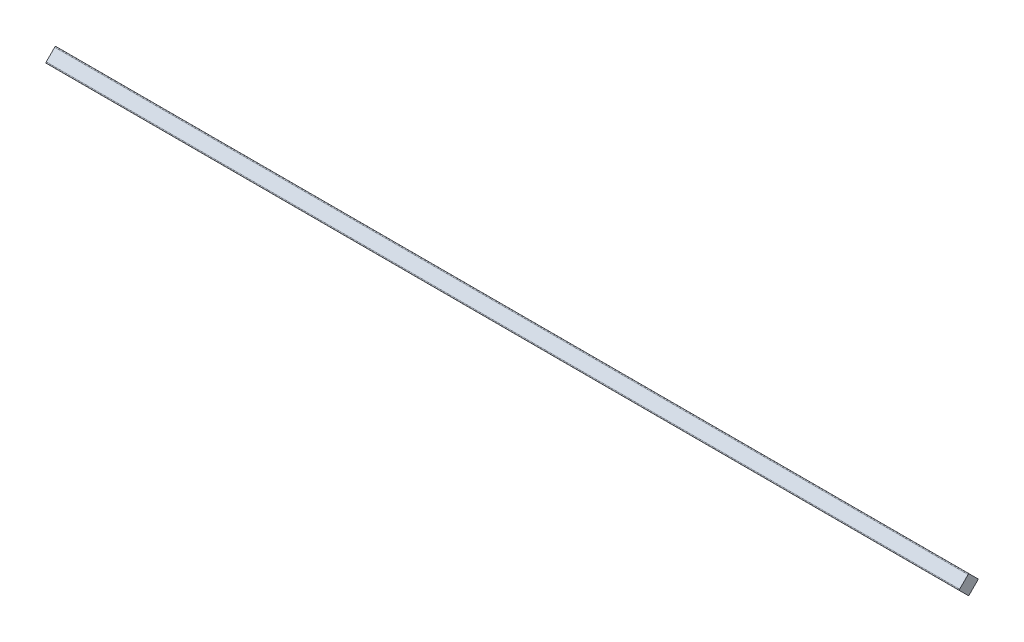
ISO-10303-21;
HEADER;
FILE_DESCRIPTION(('STEP AP214'),'2;1');
FILE_NAME('part.step','',(''),(''),'','','');
FILE_SCHEMA(('AUTOMOTIVE_DESIGN { 1 0 10303 214 1 1 1 1 }'));
ENDSEC;
DATA;
#1=APPLICATION_CONTEXT('core data for automotive mechanical design processes');
#2=APPLICATION_PROTOCOL_DEFINITION('international standard','automotive_design',2000,#1);
#3=PRODUCT_CONTEXT('',#1,'mechanical');
#4=PRODUCT('Part','Part','',(#3));
#5=PRODUCT_RELATED_PRODUCT_CATEGORY('part','',(#4));
#6=PRODUCT_DEFINITION_FORMATION('','',#4);
#7=PRODUCT_DEFINITION_CONTEXT('part definition',#1,'design');
#8=PRODUCT_DEFINITION('design','',#6,#7);
#9=PRODUCT_DEFINITION_SHAPE('','',#8);
#10=(LENGTH_UNIT() NAMED_UNIT(*) SI_UNIT(.MILLI.,.METRE.));
#11=(NAMED_UNIT(*) PLANE_ANGLE_UNIT() SI_UNIT($,.RADIAN.));
#12=(NAMED_UNIT(*) SI_UNIT($,.STERADIAN.) SOLID_ANGLE_UNIT());
#13=UNCERTAINTY_MEASURE_WITH_UNIT(LENGTH_MEASURE(1.E-05),#10,'distance_accuracy_value','');
#14=(GEOMETRIC_REPRESENTATION_CONTEXT(3) GLOBAL_UNCERTAINTY_ASSIGNED_CONTEXT((#13)) GLOBAL_UNIT_ASSIGNED_CONTEXT((#10,
#11,#12)) REPRESENTATION_CONTEXT('',''));
#15=CARTESIAN_POINT('',(0.,0.,0.));
#16=DIRECTION('',(0.,0.,1.));
#17=DIRECTION('',(1.,0.,0.));
#18=AXIS2_PLACEMENT_3D('',#15,#16,#17);
#19=CARTESIAN_POINT('',(3000.,0.,-31.8198051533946));
#20=DIRECTION('',(0.,-0.707106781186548,0.707106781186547));
#21=DIRECTION('',(0.,-0.707106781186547,-0.707106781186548));
#22=AXIS2_PLACEMENT_3D('',#19,#20,#21);
#23=PLANE('',#22);
#24=DIRECTION('',(0.,0.707106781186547,0.707106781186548));
#25=VECTOR('',#24,1.);
#26=CARTESIAN_POINT('',(3000.,0.,-31.8198051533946));
#27=LINE('',#26,#25);
#28=CARTESIAN_POINT('',(3000.,2.12132034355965,-29.698484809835));
#29=VERTEX_POINT('',#28);
#30=CARTESIAN_POINT('',(3000.,29.698484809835,-2.12132034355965));
#31=VERTEX_POINT('',#30);
#32=EDGE_CURVE('E120',#29,#31,#27,.T.);
#33=ORIENTED_EDGE('',*,*,#32,.F.);
#34=DIRECTION('',(-1.,0.,0.));
#35=VECTOR('',#34,1.);
#36=CARTESIAN_POINT('',(3000.,2.12132034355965,-29.698484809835));
#37=LINE('',#36,#35);
#38=CARTESIAN_POINT('',(0.,2.12132034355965,-29.698484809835));
#39=VERTEX_POINT('',#38);
#40=EDGE_CURVE('E11',#29,#39,#37,.T.);
#41=ORIENTED_EDGE('',*,*,#40,.T.);
#42=DIRECTION('',(0.,0.707106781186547,0.707106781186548));
#43=VECTOR('',#42,1.);
#44=CARTESIAN_POINT('',(0.,0.,-31.8198051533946));
#45=LINE('',#44,#43);
#46=CARTESIAN_POINT('',(0.,29.698484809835,-2.12132034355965));
#47=VERTEX_POINT('',#46);
#48=EDGE_CURVE('E122',#39,#47,#45,.T.);
#49=ORIENTED_EDGE('',*,*,#48,.T.);
#50=DIRECTION('',(-1.,0.,0.));
#51=VECTOR('',#50,1.);
#52=CARTESIAN_POINT('',(3000.,29.698484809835,-2.12132034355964));
#53=LINE('',#52,#51);
#54=EDGE_CURVE('E33',#47,#31,#53,.F.);
#55=ORIENTED_EDGE('',*,*,#54,.T.);
#56=EDGE_LOOP('',(#33,#41,#49,#55));
#57=FACE_BOUND('',#56,.T.);
#58=ADVANCED_FACE('F26',(#57),#23,.F.);
#59=CARTESIAN_POINT('',(3000.,31.8198051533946,0.));
#60=DIRECTION('',(0.,-0.707106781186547,-0.707106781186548));
#61=DIRECTION('',(0.,0.707106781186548,-0.707106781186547));
#62=AXIS2_PLACEMENT_3D('',#59,#60,#61);
#63=PLANE('',#62);
#64=DIRECTION('',(0.,-0.707106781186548,0.707106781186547));
#65=VECTOR('',#64,1.);
#66=CARTESIAN_POINT('',(0.,31.8198051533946,0.));
#67=LINE('',#66,#65);
#68=CARTESIAN_POINT('',(0.,29.698484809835,2.12132034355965));
#69=VERTEX_POINT('',#68);
#70=CARTESIAN_POINT('',(0.,2.12132034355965,29.698484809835));
#71=VERTEX_POINT('',#70);
#72=EDGE_CURVE('E118',#69,#71,#67,.T.);
#73=ORIENTED_EDGE('',*,*,#72,.T.);
#74=DIRECTION('',(-1.,0.,0.));
#75=VECTOR('',#74,1.);
#76=CARTESIAN_POINT('',(3000.,2.12132034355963,29.698484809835));
#77=LINE('',#76,#75);
#78=CARTESIAN_POINT('',(3000.,2.12132034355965,29.698484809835));
#79=VERTEX_POINT('',#78);
#80=EDGE_CURVE('E97',#71,#79,#77,.F.);
#81=ORIENTED_EDGE('',*,*,#80,.T.);
#82=DIRECTION('',(0.,-0.707106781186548,0.707106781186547));
#83=VECTOR('',#82,1.);
#84=CARTESIAN_POINT('',(3000.,31.8198051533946,0.));
#85=LINE('',#84,#83);
#86=CARTESIAN_POINT('',(3000.,29.698484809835,2.12132034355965));
#87=VERTEX_POINT('',#86);
#88=EDGE_CURVE('E128',#87,#79,#85,.T.);
#89=ORIENTED_EDGE('',*,*,#88,.F.);
#90=DIRECTION('',(-1.,0.,0.));
#91=VECTOR('',#90,1.);
#92=CARTESIAN_POINT('',(3000.,29.698484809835,2.12132034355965));
#93=LINE('',#92,#91);
#94=EDGE_CURVE('E102',#87,#69,#93,.T.);
#95=ORIENTED_EDGE('',*,*,#94,.T.);
#96=EDGE_LOOP('',(#73,#81,#89,#95));
#97=FACE_BOUND('',#96,.T.);
#98=ADVANCED_FACE('F166',(#97),#63,.F.);
#99=CARTESIAN_POINT('',(3000.,0.,31.8198051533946));
#100=DIRECTION('',(0.,0.707106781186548,-0.707106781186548));
#101=DIRECTION('',(0.,0.707106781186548,0.707106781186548));
#102=AXIS2_PLACEMENT_3D('',#99,#100,#101);
#103=PLANE('',#102);
#104=DIRECTION('',(0.,-0.707106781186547,-0.707106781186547));
#105=VECTOR('',#104,1.);
#106=CARTESIAN_POINT('',(3000.,0.,31.8198051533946));
#107=LINE('',#106,#105);
#108=CARTESIAN_POINT('',(3000.,-2.12132034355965,29.698484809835));
#109=VERTEX_POINT('',#108);
#110=CARTESIAN_POINT('',(3000.,-29.698484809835,2.12132034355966));
#111=VERTEX_POINT('',#110);
#112=EDGE_CURVE('E111',#109,#111,#107,.T.);
#113=ORIENTED_EDGE('',*,*,#112,.F.);
#114=DIRECTION('',(-1.,0.,0.));
#115=VECTOR('',#114,1.);
#116=CARTESIAN_POINT('',(3000.,-2.12132034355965,29.698484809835));
#117=LINE('',#116,#115);
#118=CARTESIAN_POINT('',(0.,-2.12132034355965,29.698484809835));
#119=VERTEX_POINT('',#118);
#120=EDGE_CURVE('E96',#109,#119,#117,.T.);
#121=ORIENTED_EDGE('',*,*,#120,.T.);
#122=DIRECTION('',(0.,-0.707106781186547,-0.707106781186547));
#123=VECTOR('',#122,1.);
#124=CARTESIAN_POINT('',(0.,0.,31.8198051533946));
#125=LINE('',#124,#123);
#126=CARTESIAN_POINT('',(0.,-29.698484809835,2.12132034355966));
#127=VERTEX_POINT('',#126);
#128=EDGE_CURVE('E109',#119,#127,#125,.T.);
#129=ORIENTED_EDGE('',*,*,#128,.T.);
#130=DIRECTION('',(-1.,0.,0.));
#131=VECTOR('',#130,1.);
#132=CARTESIAN_POINT('',(3000.,-29.698484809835,2.12132034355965));
#133=LINE('',#132,#131);
#134=EDGE_CURVE('E113',#127,#111,#133,.F.);
#135=ORIENTED_EDGE('',*,*,#134,.T.);
#136=EDGE_LOOP('',(#113,#121,#129,#135));
#137=FACE_BOUND('',#136,.T.);
#138=ADVANCED_FACE('F108',(#137),#103,.F.);
#139=CARTESIAN_POINT('',(3000.,-31.8198051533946,0.));
#140=DIRECTION('',(0.,0.707106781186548,0.707106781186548));
#141=DIRECTION('',(0.,-0.707106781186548,0.707106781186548));
#142=AXIS2_PLACEMENT_3D('',#139,#140,#141);
#143=PLANE('',#142);
#144=DIRECTION('',(0.,0.707106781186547,-0.707106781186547));
#145=VECTOR('',#144,1.);
#146=CARTESIAN_POINT('',(3000.,-31.8198051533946,0.));
#147=LINE('',#146,#145);
#148=CARTESIAN_POINT('',(3000.,-29.698484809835,-2.12132034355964));
#149=VERTEX_POINT('',#148);
#150=CARTESIAN_POINT('',(3000.,-2.12132034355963,-29.698484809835));
#151=VERTEX_POINT('',#150);
#152=EDGE_CURVE('E132',#149,#151,#147,.T.);
#153=ORIENTED_EDGE('',*,*,#152,.F.);
#154=DIRECTION('',(-1.,0.,0.));
#155=VECTOR('',#154,1.);
#156=CARTESIAN_POINT('',(3000.,-29.698484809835,-2.12132034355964));
#157=LINE('',#156,#155);
#158=CARTESIAN_POINT('',(0.,-29.698484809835,-2.12132034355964));
#159=VERTEX_POINT('',#158);
#160=EDGE_CURVE('E150',#149,#159,#157,.T.);
#161=ORIENTED_EDGE('',*,*,#160,.T.);
#162=DIRECTION('',(0.,0.707106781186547,-0.707106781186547));
#163=VECTOR('',#162,1.);
#164=CARTESIAN_POINT('',(0.,-31.8198051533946,0.));
#165=LINE('',#164,#163);
#166=CARTESIAN_POINT('',(0.,-2.12132034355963,-29.698484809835));
#167=VERTEX_POINT('',#166);
#168=EDGE_CURVE('E117',#159,#167,#165,.T.);
#169=ORIENTED_EDGE('',*,*,#168,.T.);
#170=DIRECTION('',(-1.,0.,0.));
#171=VECTOR('',#170,1.);
#172=CARTESIAN_POINT('',(3000.,-2.12132034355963,-29.698484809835));
#173=LINE('',#172,#171);
#174=EDGE_CURVE('E40',#167,#151,#173,.F.);
#175=ORIENTED_EDGE('',*,*,#174,.T.);
#176=EDGE_LOOP('',(#153,#161,#169,#175));
#177=FACE_BOUND('',#176,.T.);
#178=ADVANCED_FACE('F168',(#177),#143,.F.);
#179=CARTESIAN_POINT('',(3000.,31.8198051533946,0.));
#180=DIRECTION('',(1.,0.,0.));
#181=DIRECTION('',(0.,0.,-1.));
#182=AXIS2_PLACEMENT_3D('',#179,#180,#181);
#183=PLANE('',#182);
#184=ORIENTED_EDGE('',*,*,#88,.T.);
#185=CARTESIAN_POINT('',(3000.,0.,27.5771644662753));
#186=DIRECTION('',(1.,0.,0.));
#187=DIRECTION('',(0.,0.,-1.));
#188=AXIS2_PLACEMENT_3D('',#185,#186,#187);
#189=CIRCLE('',#188,3.);
#190=EDGE_CURVE('E147',#79,#109,#189,.T.);
#191=ORIENTED_EDGE('',*,*,#190,.T.);
#192=ORIENTED_EDGE('',*,*,#112,.T.);
#193=CARTESIAN_POINT('',(3000.,-27.5771644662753,0.));
#194=DIRECTION('',(1.,0.,0.));
#195=DIRECTION('',(0.,0.,-1.));
#196=AXIS2_PLACEMENT_3D('',#193,#194,#195);
#197=CIRCLE('',#196,3.);
#198=EDGE_CURVE('E47',#111,#149,#197,.T.);
#199=ORIENTED_EDGE('',*,*,#198,.T.);
#200=ORIENTED_EDGE('',*,*,#152,.T.);
#201=CARTESIAN_POINT('',(3000.,0.,-27.5771644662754));
#202=DIRECTION('',(1.,0.,0.));
#203=DIRECTION('',(0.,0.,-1.));
#204=AXIS2_PLACEMENT_3D('',#201,#202,#203);
#205=CIRCLE('',#204,3.);
#206=EDGE_CURVE('E144',#151,#29,#205,.T.);
#207=ORIENTED_EDGE('',*,*,#206,.T.);
#208=ORIENTED_EDGE('',*,*,#32,.T.);
#209=CARTESIAN_POINT('',(3000.,27.5771644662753,0.));
#210=DIRECTION('',(1.,0.,0.));
#211=DIRECTION('',(0.,0.,-1.));
#212=AXIS2_PLACEMENT_3D('',#209,#210,#211);
#213=CIRCLE('',#212,3.);
#214=EDGE_CURVE('E142',#31,#87,#213,.T.);
#215=ORIENTED_EDGE('',*,*,#214,.T.);
#216=EDGE_LOOP('',(#184,#191,#192,#199,#200,#207,#208,#215));
#217=FACE_BOUND('',#216,.T.);
#218=ADVANCED_FACE('F160',(#217),#183,.T.);
#219=CARTESIAN_POINT('',(0.,31.8198051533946,0.));
#220=DIRECTION('',(1.,0.,0.));
#221=DIRECTION('',(0.,0.,-1.));
#222=AXIS2_PLACEMENT_3D('',#219,#220,#221);
#223=PLANE('',#222);
#224=ORIENTED_EDGE('',*,*,#128,.F.);
#225=CARTESIAN_POINT('',(0.,0.,27.5771644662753));
#226=DIRECTION('',(1.,0.,0.));
#227=DIRECTION('',(0.,0.,-1.));
#228=AXIS2_PLACEMENT_3D('',#225,#226,#227);
#229=CIRCLE('',#228,3.);
#230=EDGE_CURVE('E92',#119,#71,#229,.F.);
#231=ORIENTED_EDGE('',*,*,#230,.T.);
#232=ORIENTED_EDGE('',*,*,#72,.F.);
#233=CARTESIAN_POINT('',(0.,27.5771644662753,0.));
#234=DIRECTION('',(1.,0.,0.));
#235=DIRECTION('',(0.,0.,-1.));
#236=AXIS2_PLACEMENT_3D('',#233,#234,#235);
#237=CIRCLE('',#236,3.);
#238=EDGE_CURVE('E112',#69,#47,#237,.F.);
#239=ORIENTED_EDGE('',*,*,#238,.T.);
#240=ORIENTED_EDGE('',*,*,#48,.F.);
#241=CARTESIAN_POINT('',(0.,0.,-27.5771644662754));
#242=DIRECTION('',(1.,0.,0.));
#243=DIRECTION('',(0.,0.,-1.));
#244=AXIS2_PLACEMENT_3D('',#241,#242,#243);
#245=CIRCLE('',#244,3.);
#246=EDGE_CURVE('E136',#39,#167,#245,.F.);
#247=ORIENTED_EDGE('',*,*,#246,.T.);
#248=ORIENTED_EDGE('',*,*,#168,.F.);
#249=CARTESIAN_POINT('',(0.,-27.5771644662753,0.));
#250=DIRECTION('',(1.,0.,0.));
#251=DIRECTION('',(0.,0.,-1.));
#252=AXIS2_PLACEMENT_3D('',#249,#250,#251);
#253=CIRCLE('',#252,3.);
#254=EDGE_CURVE('E103',#159,#127,#253,.F.);
#255=ORIENTED_EDGE('',*,*,#254,.T.);
#256=EDGE_LOOP('',(#224,#231,#232,#239,#240,#247,#248,#255));
#257=FACE_BOUND('',#256,.T.);
#258=ADVANCED_FACE('F115',(#257),#223,.F.);
#259=CARTESIAN_POINT('',(3000.,0.,27.5771644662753));
#260=DIRECTION('',(-1.,0.,0.));
#261=DIRECTION('',(0.,0.,1.));
#262=AXIS2_PLACEMENT_3D('',#259,#260,#261);
#263=CYLINDRICAL_SURFACE('',#262,3.);
#264=ORIENTED_EDGE('',*,*,#190,.F.);
#265=ORIENTED_EDGE('',*,*,#80,.F.);
#266=ORIENTED_EDGE('',*,*,#230,.F.);
#267=ORIENTED_EDGE('',*,*,#120,.F.);
#268=EDGE_LOOP('',(#264,#265,#266,#267));
#269=FACE_BOUND('',#268,.T.);
#270=ADVANCED_FACE('F95',(#269),#263,.T.);
#271=CARTESIAN_POINT('',(3000.,-27.5771644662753,0.));
#272=DIRECTION('',(-1.,0.,0.));
#273=DIRECTION('',(0.,0.,1.));
#274=AXIS2_PLACEMENT_3D('',#271,#272,#273);
#275=CYLINDRICAL_SURFACE('',#274,3.);
#276=ORIENTED_EDGE('',*,*,#198,.F.);
#277=ORIENTED_EDGE('',*,*,#134,.F.);
#278=ORIENTED_EDGE('',*,*,#254,.F.);
#279=ORIENTED_EDGE('',*,*,#160,.F.);
#280=EDGE_LOOP('',(#276,#277,#278,#279));
#281=FACE_BOUND('',#280,.T.);
#282=ADVANCED_FACE('F172',(#281),#275,.T.);
#283=CARTESIAN_POINT('',(3000.,0.,-27.5771644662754));
#284=DIRECTION('',(-1.,0.,0.));
#285=DIRECTION('',(0.,0.,1.));
#286=AXIS2_PLACEMENT_3D('',#283,#284,#285);
#287=CYLINDRICAL_SURFACE('',#286,3.);
#288=ORIENTED_EDGE('',*,*,#206,.F.);
#289=ORIENTED_EDGE('',*,*,#174,.F.);
#290=ORIENTED_EDGE('',*,*,#246,.F.);
#291=ORIENTED_EDGE('',*,*,#40,.F.);
#292=EDGE_LOOP('',(#288,#289,#290,#291));
#293=FACE_BOUND('',#292,.T.);
#294=ADVANCED_FACE('F170',(#293),#287,.T.);
#295=CARTESIAN_POINT('',(3000.,27.5771644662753,0.));
#296=DIRECTION('',(-1.,0.,0.));
#297=DIRECTION('',(0.,0.,1.));
#298=AXIS2_PLACEMENT_3D('',#295,#296,#297);
#299=CYLINDRICAL_SURFACE('',#298,3.);
#300=ORIENTED_EDGE('',*,*,#214,.F.);
#301=ORIENTED_EDGE('',*,*,#54,.F.);
#302=ORIENTED_EDGE('',*,*,#238,.F.);
#303=ORIENTED_EDGE('',*,*,#94,.F.);
#304=EDGE_LOOP('',(#300,#301,#302,#303));
#305=FACE_BOUND('',#304,.T.);
#306=ADVANCED_FACE('F164',(#305),#299,.T.);
#307=CLOSED_SHELL('',(#58,#98,#138,#178,#218,#258,#270,#282,#294,#306));
#308=MANIFOLD_SOLID_BREP('B2',#307);
#309=ADVANCED_BREP_SHAPE_REPRESENTATION('',(#18,#308),#14);
#310=SHAPE_DEFINITION_REPRESENTATION(#9,#309);
ENDSEC;
END-ISO-10303-21;
